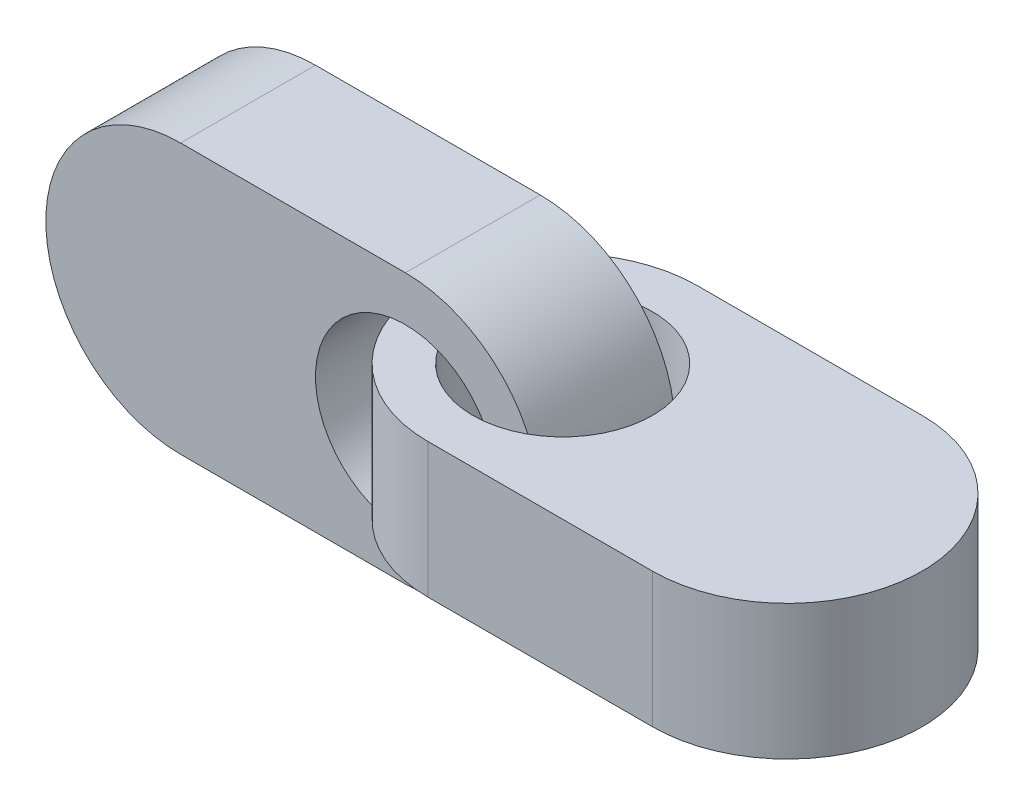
from build123d import *

# Parameters (mm, degrees)
SKETCH1_R           = 2
BOSS_EXTRUDE1_DEPTH = 1.5
SKETCH2_R           = 2
BOSS_EXTRUDE2_DEPTH = 1.5


with BuildPart() as part:
    # Sketch1 → Boss-Extrude1 (new, symmetric)
    with BuildSketch(Plane.XY):
        with BuildLine():
            Line((0, -3), (-5, -3))
            ThreePointArc((-5, -3), (-8, 0), (-5, 3))
            Line((-5, 3), (0, 3))
            ThreePointArc((0, 3), (3, 0), (0, -3))
        make_face()
        Circle(SKETCH1_R, mode=Mode.SUBTRACT)
    extrude(amount=BOSS_EXTRUDE1_DEPTH, both=True)


with BuildPart() as body_2:
    # Sketch2 → Boss-Extrude2 (new, symmetric)
    with BuildSketch(Plane(origin=(0, 0, 0), x_dir=(1, 0, 0), z_dir=(0, 1, 0))):
        with BuildLine():
            Line((2, 3), (7, 3))
            ThreePointArc((7, 3), (10, 0), (7, -3))
            Line((7, -3), (2, -3))
            ThreePointArc((2, -3), (-1, 0), (2, 3))
        make_face()
        with Locations(Location((2, 0, 0), (0, 0, 270))):
            Circle(SKETCH2_R, mode=Mode.SUBTRACT)
    extrude(amount=BOSS_EXTRUDE2_DEPTH, both=True)


solid = Compound([part.part, body_2.part])
